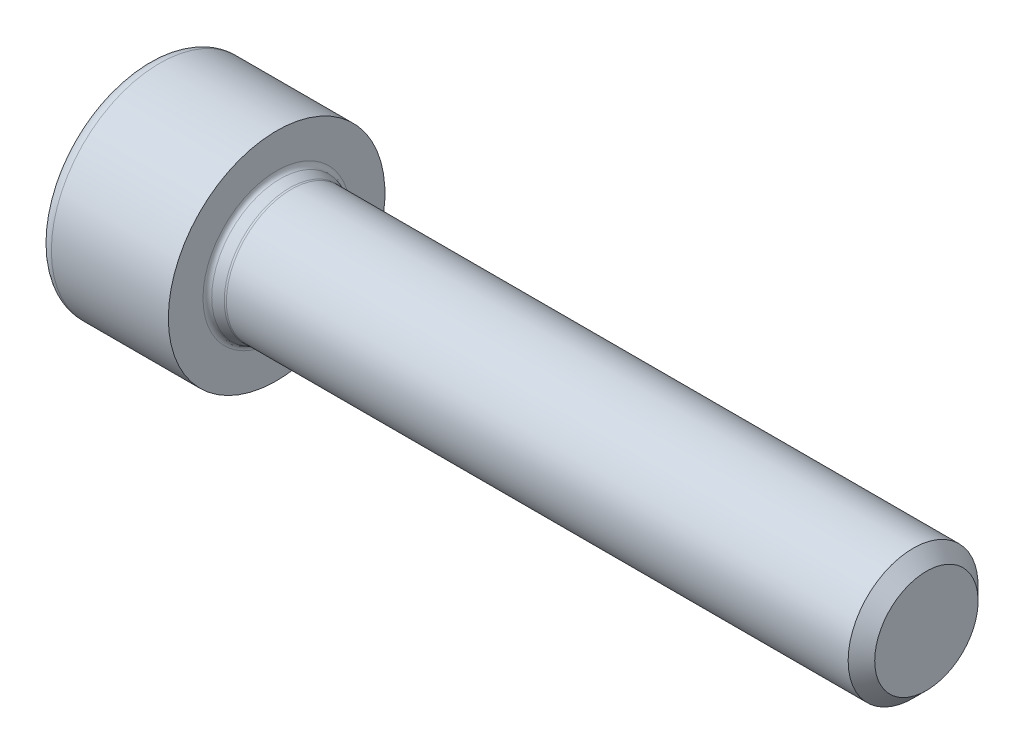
from build123d import *

# Parameters (mm, degrees)
EXTRUSION1_DEPTH = 6


with BuildPart() as part:
    # Esquisse1 → R_volution1 (revolve)
    with BuildSketch(Plane(origin=(0, 0, 0), x_dir=(1, 0, 0), z_dir=(0, 1, 0)), mode=Mode.PRIVATE) as r_volution1_sk:
        with BuildLine():
            Line((-0.856624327, 0), (-2.3, 2.5))
            Line((-2.3, 2.5), (-5.64, 2.5))
            Line((-5.64, 2.5), (-6, 2.86))
            Line((-6, 2.86), (-6, 4.4))
            ThreePointArc((-6, 4.4), (-5.824264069, 4.824264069), (-5.4, 5))
            Line((-5.4, 5), (0, 5))
            Line((0, 5), (0, 3.4))
            ThreePointArc((0, 3.4), (0.046179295, 3.255234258), (0.167656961, 3.163949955))
            Line((0.167656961, 3.163949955), (0.597656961, 3.013949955))
            ThreePointArc((0.597656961, 3.013949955), (0.638241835, 3.003512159), (0.68, 3))
            Line((0.68, 3), (29.3865, 3))
            Line((29.3865, 3), (30, 2.3865))
            Line((30, 2.3865), (30, 0))
            Line((30, 0), (-0.856624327, 0))
        make_face()
    revolve(r_volution1_sk.sketch.rotate(Axis((33, 0, 0), (-1, 0, 0)), 180), axis=Axis((33, 0, 0), (-1, 0, 0)))

    # Esquisse2 → Extrusion1 (cut)
    with BuildSketch(Plane(origin=(-2.3, 0, 0), x_dir=(0, 0, -1), z_dir=(1, 0, 0))):
        Polygon((-2.5, 1.443375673), (-2.5, -1.443375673), (0, -2.886751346), (2.5, -1.443375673), (2.5, 1.443375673), (0, 2.886751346), align=None)
    extrude(amount=-EXTRUSION1_DEPTH, mode=Mode.SUBTRACT)


solid = part.part
